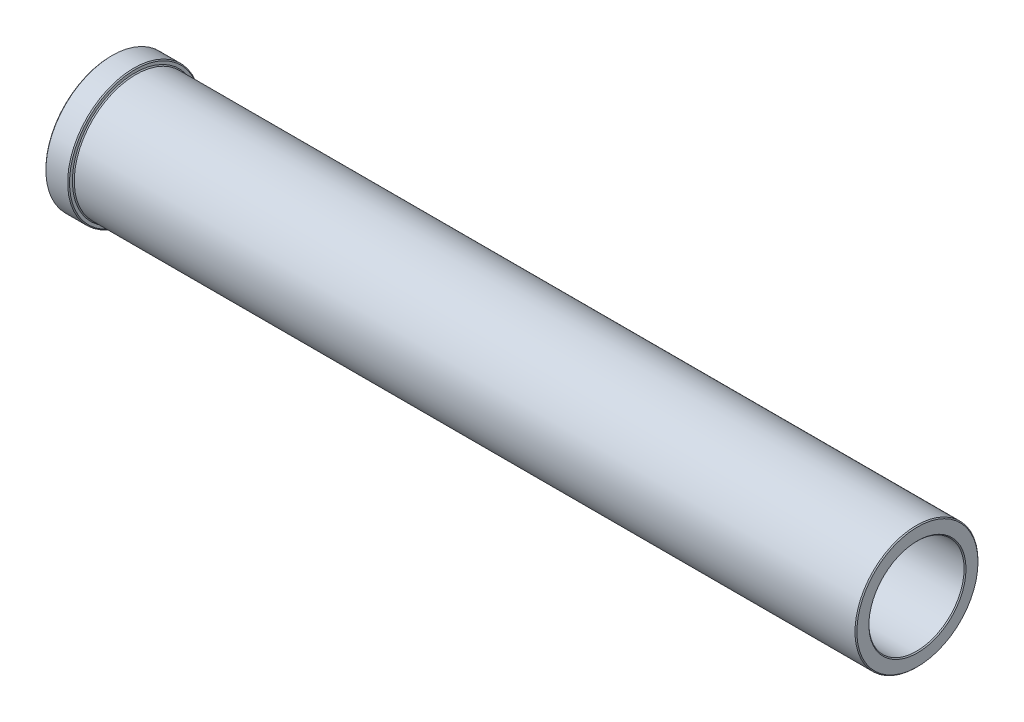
ISO-10303-21;
HEADER;
FILE_DESCRIPTION(('STEP AP214'),'2;1');
FILE_NAME('part.step','',(''),(''),'','','');
FILE_SCHEMA(('AUTOMOTIVE_DESIGN { 1 0 10303 214 1 1 1 1 }'));
ENDSEC;
DATA;
#1=APPLICATION_CONTEXT('core data for automotive mechanical design processes');
#2=APPLICATION_PROTOCOL_DEFINITION('international standard','automotive_design',2000,#1);
#3=PRODUCT_CONTEXT('',#1,'mechanical');
#4=PRODUCT('Part','Part','',(#3));
#5=PRODUCT_RELATED_PRODUCT_CATEGORY('part','',(#4));
#6=PRODUCT_DEFINITION_FORMATION('','',#4);
#7=PRODUCT_DEFINITION_CONTEXT('part definition',#1,'design');
#8=PRODUCT_DEFINITION('design','',#6,#7);
#9=PRODUCT_DEFINITION_SHAPE('','',#8);
#10=(LENGTH_UNIT() NAMED_UNIT(*) SI_UNIT(.MILLI.,.METRE.));
#11=(NAMED_UNIT(*) PLANE_ANGLE_UNIT() SI_UNIT($,.RADIAN.));
#12=(NAMED_UNIT(*) SI_UNIT($,.STERADIAN.) SOLID_ANGLE_UNIT());
#13=UNCERTAINTY_MEASURE_WITH_UNIT(LENGTH_MEASURE(1.E-05),#10,'distance_accuracy_value','');
#14=(GEOMETRIC_REPRESENTATION_CONTEXT(3) GLOBAL_UNCERTAINTY_ASSIGNED_CONTEXT((#13)) GLOBAL_UNIT_ASSIGNED_CONTEXT((#10,
#11,#12)) REPRESENTATION_CONTEXT('',''));
#15=CARTESIAN_POINT('',(0.,0.,0.));
#16=DIRECTION('',(0.,0.,1.));
#17=DIRECTION('',(1.,0.,0.));
#18=AXIS2_PLACEMENT_3D('',#15,#16,#17);
#19=CARTESIAN_POINT('',(-851.,0.,0.));
#20=DIRECTION('',(1.,0.,0.));
#21=DIRECTION('',(0.,0.,-1.));
#22=AXIS2_PLACEMENT_3D('',#19,#20,#21);
#23=CONICAL_SURFACE('',#22,69.9999999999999,0.785398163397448);
#24=CARTESIAN_POINT('',(-852.,0.,0.));
#25=DIRECTION('',(1.,0.,0.));
#26=DIRECTION('',(0.,0.,-1.));
#27=AXIS2_PLACEMENT_3D('',#24,#25,#26);
#28=CIRCLE('',#27,68.9999999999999);
#29=CARTESIAN_POINT('',(-852.,0.,-68.9999999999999));
#30=VERTEX_POINT('',#29);
#31=EDGE_CURVE('E94',#30,#30,#28,.T.);
#32=ORIENTED_EDGE('',*,*,#31,.T.);
#33=EDGE_LOOP('',(#32));
#34=FACE_BOUND('',#33,.T.);
#35=CARTESIAN_POINT('',(-851.,0.,0.));
#36=DIRECTION('',(1.,0.,0.));
#37=DIRECTION('',(0.,0.,-1.));
#38=AXIS2_PLACEMENT_3D('',#35,#36,#37);
#39=CIRCLE('',#38,69.9999999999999);
#40=CARTESIAN_POINT('',(-851.,0.,-69.9999999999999));
#41=VERTEX_POINT('',#40);
#42=EDGE_CURVE('E12',#41,#41,#39,.T.);
#43=ORIENTED_EDGE('',*,*,#42,.F.);
#44=EDGE_LOOP('',(#43));
#45=FACE_BOUND('',#44,.T.);
#46=ADVANCED_FACE('F42',(#34,#45),#23,.T.);
#47=CARTESIAN_POINT('',(38.3644535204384,0.,0.));
#48=DIRECTION('',(1.,0.,0.));
#49=DIRECTION('',(0.,0.,-1.));
#50=AXIS2_PLACEMENT_3D('',#47,#48,#49);
#51=CYLINDRICAL_SURFACE('',#50,69.9999999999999);
#52=ORIENTED_EDGE('',*,*,#42,.T.);
#53=EDGE_LOOP('',(#52));
#54=FACE_BOUND('',#53,.T.);
#55=CARTESIAN_POINT('',(-828.,0.,0.));
#56=DIRECTION('',(1.,0.,0.));
#57=DIRECTION('',(0.,0.,-1.));
#58=AXIS2_PLACEMENT_3D('',#55,#56,#57);
#59=CIRCLE('',#58,69.9999999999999);
#60=CARTESIAN_POINT('',(-828.,0.,-69.9999999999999));
#61=VERTEX_POINT('',#60);
#62=EDGE_CURVE('E48',#61,#61,#59,.T.);
#63=ORIENTED_EDGE('',*,*,#62,.F.);
#64=EDGE_LOOP('',(#63));
#65=FACE_BOUND('',#64,.T.);
#66=ADVANCED_FACE('F112',(#54,#65),#51,.T.);
#67=CARTESIAN_POINT('',(-827.,0.,0.));
#68=DIRECTION('',(-1.,0.,0.));
#69=DIRECTION('',(0.,0.,1.));
#70=AXIS2_PLACEMENT_3D('',#67,#68,#69);
#71=CONICAL_SURFACE('',#70,68.9999999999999,0.785398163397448);
#72=ORIENTED_EDGE('',*,*,#62,.T.);
#73=EDGE_LOOP('',(#72));
#74=FACE_BOUND('',#73,.T.);
#75=CARTESIAN_POINT('',(-827.,0.,0.));
#76=DIRECTION('',(1.,0.,0.));
#77=DIRECTION('',(0.,0.,-1.));
#78=AXIS2_PLACEMENT_3D('',#75,#76,#77);
#79=CIRCLE('',#78,68.9999999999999);
#80=CARTESIAN_POINT('',(-827.,0.,-68.9999999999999));
#81=VERTEX_POINT('',#80);
#82=EDGE_CURVE('E52',#81,#81,#79,.T.);
#83=ORIENTED_EDGE('',*,*,#82,.F.);
#84=EDGE_LOOP('',(#83));
#85=FACE_BOUND('',#84,.T.);
#86=ADVANCED_FACE('F116',(#74,#85),#71,.T.);
#87=CARTESIAN_POINT('',(-827.,68.9999999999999,0.));
#88=DIRECTION('',(1.,0.,0.));
#89=DIRECTION('',(0.,0.,-1.));
#90=AXIS2_PLACEMENT_3D('',#87,#88,#89);
#91=PLANE('',#90);
#92=ORIENTED_EDGE('',*,*,#82,.T.);
#93=EDGE_LOOP('',(#92));
#94=FACE_BOUND('',#93,.T.);
#95=CARTESIAN_POINT('',(-827.,0.,0.));
#96=DIRECTION('',(1.,0.,0.));
#97=DIRECTION('',(0.,0.,-1.));
#98=AXIS2_PLACEMENT_3D('',#95,#96,#97);
#99=CIRCLE('',#98,65.9999999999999);
#100=CARTESIAN_POINT('',(-827.,0.,-65.9999999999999));
#101=VERTEX_POINT('',#100);
#102=EDGE_CURVE('E56',#101,#101,#99,.T.);
#103=ORIENTED_EDGE('',*,*,#102,.F.);
#104=EDGE_LOOP('',(#103));
#105=FACE_BOUND('',#104,.T.);
#106=ADVANCED_FACE('F120',(#94,#105),#91,.T.);
#107=CARTESIAN_POINT('',(-826.,0.,0.));
#108=DIRECTION('',(-1.,0.,0.));
#109=DIRECTION('',(0.,0.,1.));
#110=AXIS2_PLACEMENT_3D('',#107,#108,#109);
#111=CONICAL_SURFACE('',#110,64.9999999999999,0.785398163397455);
#112=ORIENTED_EDGE('',*,*,#102,.T.);
#113=EDGE_LOOP('',(#112));
#114=FACE_BOUND('',#113,.T.);
#115=CARTESIAN_POINT('',(-826.,0.,0.));
#116=DIRECTION('',(1.,0.,0.));
#117=DIRECTION('',(0.,0.,-1.));
#118=AXIS2_PLACEMENT_3D('',#115,#116,#117);
#119=CIRCLE('',#118,64.9999999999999);
#120=CARTESIAN_POINT('',(-826.,0.,-64.9999999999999));
#121=VERTEX_POINT('',#120);
#122=EDGE_CURVE('E61',#121,#121,#119,.T.);
#123=ORIENTED_EDGE('',*,*,#122,.F.);
#124=EDGE_LOOP('',(#123));
#125=FACE_BOUND('',#124,.T.);
#126=ADVANCED_FACE('F126',(#114,#125),#111,.T.);
#127=CARTESIAN_POINT('',(38.3644535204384,0.,0.));
#128=DIRECTION('',(1.,0.,0.));
#129=DIRECTION('',(0.,0.,-1.));
#130=AXIS2_PLACEMENT_3D('',#127,#128,#129);
#131=CYLINDRICAL_SURFACE('',#130,64.9999999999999);
#132=ORIENTED_EDGE('',*,*,#122,.T.);
#133=EDGE_LOOP('',(#132));
#134=FACE_BOUND('',#133,.T.);
#135=CARTESIAN_POINT('',(-1.,0.,0.));
#136=DIRECTION('',(1.,0.,0.));
#137=DIRECTION('',(0.,0.,-1.));
#138=AXIS2_PLACEMENT_3D('',#135,#136,#137);
#139=CIRCLE('',#138,65.);
#140=CARTESIAN_POINT('',(-1.,0.,-65.));
#141=VERTEX_POINT('',#140);
#142=EDGE_CURVE('E64',#141,#141,#139,.T.);
#143=ORIENTED_EDGE('',*,*,#142,.F.);
#144=EDGE_LOOP('',(#143));
#145=FACE_BOUND('',#144,.T.);
#146=ADVANCED_FACE('F130',(#134,#145),#131,.T.);
#147=CARTESIAN_POINT('',(0.,0.,0.));
#148=DIRECTION('',(-1.,0.,0.));
#149=DIRECTION('',(0.,0.,1.));
#150=AXIS2_PLACEMENT_3D('',#147,#148,#149);
#151=CONICAL_SURFACE('',#150,64.,0.785398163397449);
#152=ORIENTED_EDGE('',*,*,#142,.T.);
#153=EDGE_LOOP('',(#152));
#154=FACE_BOUND('',#153,.T.);
#155=CARTESIAN_POINT('',(0.,0.,0.));
#156=DIRECTION('',(1.,0.,0.));
#157=DIRECTION('',(0.,0.,-1.));
#158=AXIS2_PLACEMENT_3D('',#155,#156,#157);
#159=CIRCLE('',#158,64.);
#160=CARTESIAN_POINT('',(0.,0.,-64.));
#161=VERTEX_POINT('',#160);
#162=EDGE_CURVE('E67',#161,#161,#159,.T.);
#163=ORIENTED_EDGE('',*,*,#162,.F.);
#164=EDGE_LOOP('',(#163));
#165=FACE_BOUND('',#164,.T.);
#166=ADVANCED_FACE('F134',(#154,#165),#151,.T.);
#167=CARTESIAN_POINT('',(0.,51.3,0.));
#168=DIRECTION('',(1.,0.,0.));
#169=DIRECTION('',(0.,0.,-1.));
#170=AXIS2_PLACEMENT_3D('',#167,#168,#169);
#171=PLANE('',#170);
#172=ORIENTED_EDGE('',*,*,#162,.T.);
#173=EDGE_LOOP('',(#172));
#174=FACE_BOUND('',#173,.T.);
#175=CARTESIAN_POINT('',(0.,0.,0.));
#176=DIRECTION('',(1.,0.,0.));
#177=DIRECTION('',(0.,0.,-1.));
#178=AXIS2_PLACEMENT_3D('',#175,#176,#177);
#179=CIRCLE('',#178,51.3);
#180=CARTESIAN_POINT('',(0.,0.,-51.3));
#181=VERTEX_POINT('',#180);
#182=EDGE_CURVE('E70',#181,#181,#179,.T.);
#183=ORIENTED_EDGE('',*,*,#182,.F.);
#184=EDGE_LOOP('',(#183));
#185=FACE_BOUND('',#184,.T.);
#186=ADVANCED_FACE('F138',(#174,#185),#171,.T.);
#187=CARTESIAN_POINT('',(-1.,0.,0.));
#188=DIRECTION('',(1.,0.,0.));
#189=DIRECTION('',(0.,0.,-1.));
#190=AXIS2_PLACEMENT_3D('',#187,#188,#189);
#191=CONICAL_SURFACE('',#190,50.3,0.785398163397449);
#192=ORIENTED_EDGE('',*,*,#182,.T.);
#193=EDGE_LOOP('',(#192));
#194=FACE_BOUND('',#193,.T.);
#195=CARTESIAN_POINT('',(-1.,0.,0.));
#196=DIRECTION('',(1.,0.,0.));
#197=DIRECTION('',(0.,0.,-1.));
#198=AXIS2_PLACEMENT_3D('',#195,#196,#197);
#199=CIRCLE('',#198,50.3);
#200=CARTESIAN_POINT('',(-1.,0.,-50.3));
#201=VERTEX_POINT('',#200);
#202=EDGE_CURVE('E73',#201,#201,#199,.T.);
#203=ORIENTED_EDGE('',*,*,#202,.F.);
#204=EDGE_LOOP('',(#203));
#205=FACE_BOUND('',#204,.T.);
#206=ADVANCED_FACE('F142',(#194,#205),#191,.F.);
#207=CARTESIAN_POINT('',(38.3644535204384,0.,0.));
#208=DIRECTION('',(1.,0.,0.));
#209=DIRECTION('',(0.,0.,-1.));
#210=AXIS2_PLACEMENT_3D('',#207,#208,#209);
#211=CYLINDRICAL_SURFACE('',#210,50.3);
#212=ORIENTED_EDGE('',*,*,#202,.T.);
#213=EDGE_LOOP('',(#212));
#214=FACE_BOUND('',#213,.T.);
#215=CARTESIAN_POINT('',(-121.,0.,0.));
#216=DIRECTION('',(1.,0.,0.));
#217=DIRECTION('',(0.,0.,-1.));
#218=AXIS2_PLACEMENT_3D('',#215,#216,#217);
#219=CIRCLE('',#218,50.3);
#220=CARTESIAN_POINT('',(-121.,0.,-50.3));
#221=VERTEX_POINT('',#220);
#222=EDGE_CURVE('E76',#221,#221,#219,.T.);
#223=ORIENTED_EDGE('',*,*,#222,.F.);
#224=EDGE_LOOP('',(#223));
#225=FACE_BOUND('',#224,.T.);
#226=ADVANCED_FACE('F146',(#214,#225),#211,.F.);
#227=CARTESIAN_POINT('',(-122.,0.,0.));
#228=DIRECTION('',(-1.,0.,0.));
#229=DIRECTION('',(0.,0.,1.));
#230=AXIS2_PLACEMENT_3D('',#227,#228,#229);
#231=CONICAL_SURFACE('',#230,51.3,0.785398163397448);
#232=ORIENTED_EDGE('',*,*,#222,.T.);
#233=EDGE_LOOP('',(#232));
#234=FACE_BOUND('',#233,.T.);
#235=CARTESIAN_POINT('',(-122.,0.,0.));
#236=DIRECTION('',(1.,0.,0.));
#237=DIRECTION('',(0.,0.,-1.));
#238=AXIS2_PLACEMENT_3D('',#235,#236,#237);
#239=CIRCLE('',#238,51.3);
#240=CARTESIAN_POINT('',(-122.,0.,-51.3));
#241=VERTEX_POINT('',#240);
#242=EDGE_CURVE('E79',#241,#241,#239,.T.);
#243=ORIENTED_EDGE('',*,*,#242,.F.);
#244=EDGE_LOOP('',(#243));
#245=FACE_BOUND('',#244,.T.);
#246=ADVANCED_FACE('F150',(#234,#245),#231,.F.);
#247=CARTESIAN_POINT('',(-122.,51.3,0.));
#248=DIRECTION('',(-1.,0.,0.));
#249=DIRECTION('',(0.,0.,1.));
#250=AXIS2_PLACEMENT_3D('',#247,#248,#249);
#251=PLANE('',#250);
#252=ORIENTED_EDGE('',*,*,#242,.T.);
#253=EDGE_LOOP('',(#252));
#254=FACE_BOUND('',#253,.T.);
#255=CARTESIAN_POINT('',(-122.,0.,0.));
#256=DIRECTION('',(1.,0.,0.));
#257=DIRECTION('',(0.,0.,-1.));
#258=AXIS2_PLACEMENT_3D('',#255,#256,#257);
#259=CIRCLE('',#258,53.);
#260=CARTESIAN_POINT('',(-122.,0.,-53.));
#261=VERTEX_POINT('',#260);
#262=EDGE_CURVE('E82',#261,#261,#259,.T.);
#263=ORIENTED_EDGE('',*,*,#262,.F.);
#264=EDGE_LOOP('',(#263));
#265=FACE_BOUND('',#264,.T.);
#266=ADVANCED_FACE('F154',(#254,#265),#251,.T.);
#267=CARTESIAN_POINT('',(-123.,0.,0.));
#268=DIRECTION('',(-1.,0.,0.));
#269=DIRECTION('',(0.,0.,1.));
#270=AXIS2_PLACEMENT_3D('',#267,#268,#269);
#271=CONICAL_SURFACE('',#270,54.,0.785398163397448);
#272=ORIENTED_EDGE('',*,*,#262,.T.);
#273=EDGE_LOOP('',(#272));
#274=FACE_BOUND('',#273,.T.);
#275=CARTESIAN_POINT('',(-123.,0.,0.));
#276=DIRECTION('',(1.,0.,0.));
#277=DIRECTION('',(0.,0.,-1.));
#278=AXIS2_PLACEMENT_3D('',#275,#276,#277);
#279=CIRCLE('',#278,54.);
#280=CARTESIAN_POINT('',(-123.,0.,-54.));
#281=VERTEX_POINT('',#280);
#282=EDGE_CURVE('E85',#281,#281,#279,.T.);
#283=ORIENTED_EDGE('',*,*,#282,.F.);
#284=EDGE_LOOP('',(#283));
#285=FACE_BOUND('',#284,.T.);
#286=ADVANCED_FACE('F158',(#274,#285),#271,.F.);
#287=CARTESIAN_POINT('',(38.3644535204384,0.,0.));
#288=DIRECTION('',(1.,0.,0.));
#289=DIRECTION('',(0.,0.,-1.));
#290=AXIS2_PLACEMENT_3D('',#287,#288,#289);
#291=CYLINDRICAL_SURFACE('',#290,53.9999999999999);
#292=ORIENTED_EDGE('',*,*,#282,.T.);
#293=EDGE_LOOP('',(#292));
#294=FACE_BOUND('',#293,.T.);
#295=CARTESIAN_POINT('',(-851.,0.,0.));
#296=DIRECTION('',(1.,0.,0.));
#297=DIRECTION('',(0.,0.,-1.));
#298=AXIS2_PLACEMENT_3D('',#295,#296,#297);
#299=CIRCLE('',#298,53.9999999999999);
#300=CARTESIAN_POINT('',(-851.,0.,-53.9999999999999));
#301=VERTEX_POINT('',#300);
#302=EDGE_CURVE('E88',#301,#301,#299,.T.);
#303=ORIENTED_EDGE('',*,*,#302,.F.);
#304=EDGE_LOOP('',(#303));
#305=FACE_BOUND('',#304,.T.);
#306=ADVANCED_FACE('F108',(#294,#305),#291,.F.);
#307=CARTESIAN_POINT('',(-852.,0.,0.));
#308=DIRECTION('',(-1.,0.,0.));
#309=DIRECTION('',(0.,0.,1.));
#310=AXIS2_PLACEMENT_3D('',#307,#308,#309);
#311=CONICAL_SURFACE('',#310,54.9999999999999,0.785398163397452);
#312=ORIENTED_EDGE('',*,*,#302,.T.);
#313=EDGE_LOOP('',(#312));
#314=FACE_BOUND('',#313,.T.);
#315=CARTESIAN_POINT('',(-852.,0.,0.));
#316=DIRECTION('',(1.,0.,0.));
#317=DIRECTION('',(0.,0.,-1.));
#318=AXIS2_PLACEMENT_3D('',#315,#316,#317);
#319=CIRCLE('',#318,54.9999999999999);
#320=CARTESIAN_POINT('',(-852.,0.,-54.9999999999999));
#321=VERTEX_POINT('',#320);
#322=EDGE_CURVE('E91',#321,#321,#319,.T.);
#323=ORIENTED_EDGE('',*,*,#322,.F.);
#324=EDGE_LOOP('',(#323));
#325=FACE_BOUND('',#324,.T.);
#326=ADVANCED_FACE('F102',(#314,#325),#311,.F.);
#327=CARTESIAN_POINT('',(-852.,54.9999999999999,0.));
#328=DIRECTION('',(-1.,0.,0.));
#329=DIRECTION('',(0.,0.,1.));
#330=AXIS2_PLACEMENT_3D('',#327,#328,#329);
#331=PLANE('',#330);
#332=ORIENTED_EDGE('',*,*,#322,.T.);
#333=EDGE_LOOP('',(#332));
#334=FACE_BOUND('',#333,.T.);
#335=ORIENTED_EDGE('',*,*,#31,.F.);
#336=EDGE_LOOP('',(#335));
#337=FACE_BOUND('',#336,.T.);
#338=ADVANCED_FACE('F100',(#334,#337),#331,.T.);
#339=CLOSED_SHELL('',(#46,#66,#86,#106,#126,#146,#166,#186,#206,#226,#246,#266,#286,#306,#326,#338));
#340=MANIFOLD_SOLID_BREP('B2',#339);
#341=ADVANCED_BREP_SHAPE_REPRESENTATION('',(#18,#340),#14);
#342=SHAPE_DEFINITION_REPRESENTATION(#9,#341);
ENDSEC;
END-ISO-10303-21;
